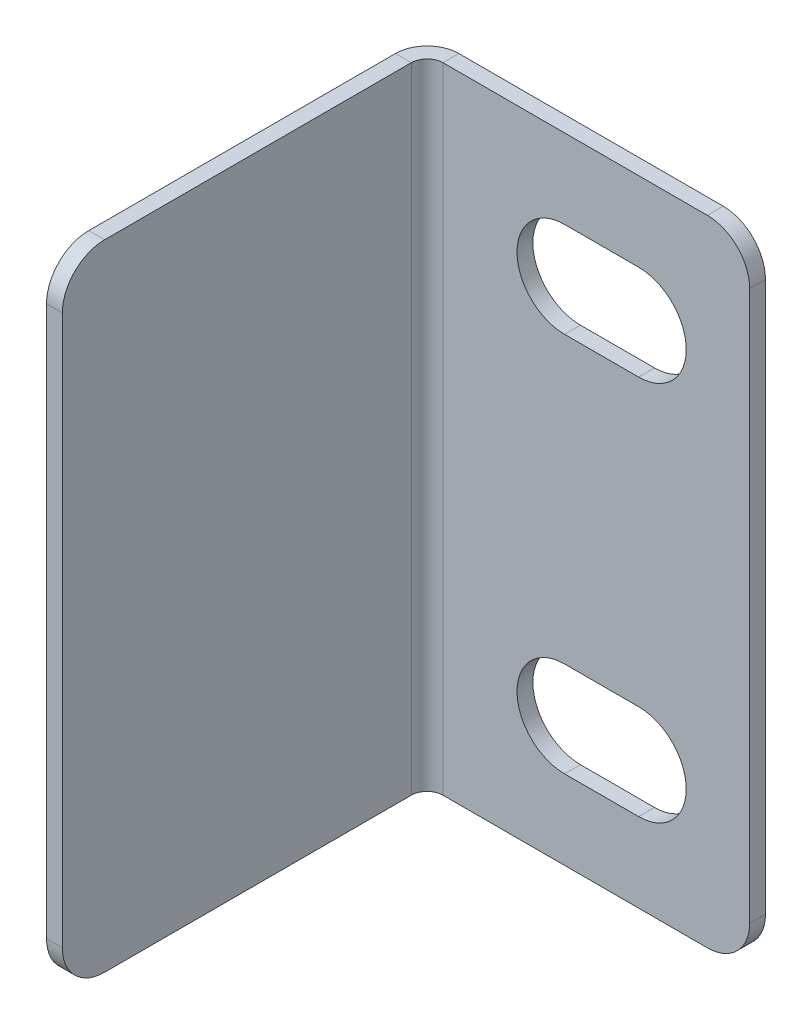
ISO-10303-21;
HEADER;
FILE_DESCRIPTION(('STEP AP214'),'2;1');
FILE_NAME('part.step','',(''),(''),'','','');
FILE_SCHEMA(('AUTOMOTIVE_DESIGN { 1 0 10303 214 1 1 1 1 }'));
ENDSEC;
DATA;
#1=APPLICATION_CONTEXT('core data for automotive mechanical design processes');
#2=APPLICATION_PROTOCOL_DEFINITION('international standard','automotive_design',2000,#1);
#3=PRODUCT_CONTEXT('',#1,'mechanical');
#4=PRODUCT('Part','Part','',(#3));
#5=PRODUCT_RELATED_PRODUCT_CATEGORY('part','',(#4));
#6=PRODUCT_DEFINITION_FORMATION('','',#4);
#7=PRODUCT_DEFINITION_CONTEXT('part definition',#1,'design');
#8=PRODUCT_DEFINITION('design','',#6,#7);
#9=PRODUCT_DEFINITION_SHAPE('','',#8);
#10=(LENGTH_UNIT() NAMED_UNIT(*) SI_UNIT(.MILLI.,.METRE.));
#11=(NAMED_UNIT(*) PLANE_ANGLE_UNIT() SI_UNIT($,.RADIAN.));
#12=(NAMED_UNIT(*) SI_UNIT($,.STERADIAN.) SOLID_ANGLE_UNIT());
#13=UNCERTAINTY_MEASURE_WITH_UNIT(LENGTH_MEASURE(1.E-05),#10,'distance_accuracy_value','');
#14=(GEOMETRIC_REPRESENTATION_CONTEXT(3) GLOBAL_UNCERTAINTY_ASSIGNED_CONTEXT((#13)) GLOBAL_UNIT_ASSIGNED_CONTEXT((#10,
#11,#12)) REPRESENTATION_CONTEXT('',''));
#15=CARTESIAN_POINT('',(0.,0.,0.));
#16=DIRECTION('',(0.,0.,1.));
#17=DIRECTION('',(1.,0.,0.));
#18=AXIS2_PLACEMENT_3D('',#15,#16,#17);
#19=CARTESIAN_POINT('',(3.00000000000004,30.,0.));
#20=DIRECTION('',(0.,1.,0.));
#21=DIRECTION('',(0.,0.,1.));
#22=AXIS2_PLACEMENT_3D('',#19,#20,#21);
#23=PLANE('',#22);
#24=DIRECTION('',(0.,0.,1.));
#25=VECTOR('',#24,1.);
#26=CARTESIAN_POINT('',(3.00000000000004,30.,0.));
#27=LINE('',#26,#25);
#28=CARTESIAN_POINT('',(3.00000000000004,30.,0.));
#29=VERTEX_POINT('',#28);
#30=CARTESIAN_POINT('',(3.00000000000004,30.,1.50000000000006));
#31=VERTEX_POINT('',#30);
#32=EDGE_CURVE('E355',#29,#31,#27,.T.);
#33=ORIENTED_EDGE('',*,*,#32,.F.);
#34=CARTESIAN_POINT('',(3.00000000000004,30.,2.99999999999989));
#35=DIRECTION('',(0.,-1.,0.));
#36=DIRECTION('',(0.,0.,-1.));
#37=AXIS2_PLACEMENT_3D('',#34,#35,#36);
#38=CIRCLE('',#37,3.);
#39=CARTESIAN_POINT('',(0.,30.,2.99999999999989));
#40=VERTEX_POINT('',#39);
#41=EDGE_CURVE('E289',#29,#40,#38,.F.);
#42=ORIENTED_EDGE('',*,*,#41,.T.);
#43=DIRECTION('',(-1.00000000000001,0.,0.));
#44=VECTOR('',#43,1.);
#45=CARTESIAN_POINT('',(1.5,30.,2.99999999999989));
#46=LINE('',#45,#44);
#47=CARTESIAN_POINT('',(1.5,30.,2.99999999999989));
#48=VERTEX_POINT('',#47);
#49=EDGE_CURVE('E352',#48,#40,#46,.T.);
#50=ORIENTED_EDGE('',*,*,#49,.F.);
#51=CARTESIAN_POINT('',(3.00000000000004,30.,2.99999999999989));
#52=DIRECTION('',(0.,1.,0.));
#53=DIRECTION('',(1.00000000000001,0.,0.));
#54=AXIS2_PLACEMENT_3D('',#51,#52,#53);
#55=CIRCLE('',#54,1.5);
#56=EDGE_CURVE('E279',#31,#48,#55,.T.);
#57=ORIENTED_EDGE('',*,*,#56,.F.);
#58=EDGE_LOOP('',(#33,#42,#50,#57));
#59=FACE_BOUND('',#58,.T.);
#60=ADVANCED_FACE('F40',(#59),#23,.T.);
#61=CARTESIAN_POINT('',(1.5,30.,2.99999999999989));
#62=DIRECTION('',(0.,1.,0.));
#63=DIRECTION('',(0.,0.,1.));
#64=AXIS2_PLACEMENT_3D('',#61,#62,#63);
#65=PLANE('',#64);
#66=DIRECTION('',(1.00000000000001,0.,0.));
#67=VECTOR('',#66,1.);
#68=CARTESIAN_POINT('',(0.,30.,1.50000000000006));
#69=LINE('',#68,#67);
#70=CARTESIAN_POINT('',(28.0000000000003,30.,1.50000000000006));
#71=VERTEX_POINT('',#70);
#72=EDGE_CURVE('E283',#71,#31,#69,.F.);
#73=ORIENTED_EDGE('',*,*,#72,.F.);
#74=DIRECTION('',(0.,0.,1.));
#75=VECTOR('',#74,1.);
#76=CARTESIAN_POINT('',(28.0000000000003,30.,2.99999999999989));
#77=LINE('',#76,#75);
#78=CARTESIAN_POINT('',(28.0000000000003,30.,0.));
#79=VERTEX_POINT('',#78);
#80=EDGE_CURVE('E11',#71,#79,#77,.F.);
#81=ORIENTED_EDGE('',*,*,#80,.T.);
#82=DIRECTION('',(-1.00000000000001,0.,0.));
#83=VECTOR('',#82,1.);
#84=CARTESIAN_POINT('',(0.,30.,0.));
#85=LINE('',#84,#83);
#86=EDGE_CURVE('E286',#79,#29,#85,.T.);
#87=ORIENTED_EDGE('',*,*,#86,.T.);
#88=ORIENTED_EDGE('',*,*,#32,.T.);
#89=EDGE_LOOP('',(#73,#81,#87,#88));
#90=FACE_BOUND('',#89,.T.);
#91=ADVANCED_FACE('F430',(#90),#65,.T.);
#92=CARTESIAN_POINT('',(0.,-30.,2.99999999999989));
#93=DIRECTION('',(0.,-1.,0.));
#94=DIRECTION('',(0.,0.,-1.));
#95=AXIS2_PLACEMENT_3D('',#92,#93,#94);
#96=PLANE('',#95);
#97=DIRECTION('',(1.00000000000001,0.,0.));
#98=VECTOR('',#97,1.);
#99=CARTESIAN_POINT('',(0.,-30.,2.99999999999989));
#100=LINE('',#99,#98);
#101=CARTESIAN_POINT('',(0.,-30.,2.99999999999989));
#102=VERTEX_POINT('',#101);
#103=CARTESIAN_POINT('',(1.5,-30.,2.99999999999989));
#104=VERTEX_POINT('',#103);
#105=EDGE_CURVE('E349',#102,#104,#100,.T.);
#106=ORIENTED_EDGE('',*,*,#105,.F.);
#107=CARTESIAN_POINT('',(3.00000000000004,-30.,2.99999999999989));
#108=DIRECTION('',(0.,-1.,0.));
#109=DIRECTION('',(0.,0.,-1.));
#110=AXIS2_PLACEMENT_3D('',#107,#108,#109);
#111=CIRCLE('',#110,3.);
#112=CARTESIAN_POINT('',(3.00000000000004,-30.,0.));
#113=VERTEX_POINT('',#112);
#114=EDGE_CURVE('E275',#113,#102,#111,.F.);
#115=ORIENTED_EDGE('',*,*,#114,.F.);
#116=DIRECTION('',(0.,0.,-1.));
#117=VECTOR('',#116,1.);
#118=CARTESIAN_POINT('',(3.00000000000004,-30.,1.50000000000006));
#119=LINE('',#118,#117);
#120=CARTESIAN_POINT('',(3.00000000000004,-30.,1.50000000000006));
#121=VERTEX_POINT('',#120);
#122=EDGE_CURVE('E345',#121,#113,#119,.T.);
#123=ORIENTED_EDGE('',*,*,#122,.F.);
#124=CARTESIAN_POINT('',(3.00000000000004,-30.,2.99999999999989));
#125=DIRECTION('',(0.,1.,0.));
#126=DIRECTION('',(1.00000000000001,0.,0.));
#127=AXIS2_PLACEMENT_3D('',#124,#125,#126);
#128=CIRCLE('',#127,1.5);
#129=EDGE_CURVE('E301',#121,#104,#128,.T.);
#130=ORIENTED_EDGE('',*,*,#129,.T.);
#131=EDGE_LOOP('',(#106,#115,#123,#130));
#132=FACE_BOUND('',#131,.T.);
#133=ADVANCED_FACE('F468',(#132),#96,.T.);
#134=CARTESIAN_POINT('',(3.00000000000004,-30.,1.50000000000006));
#135=DIRECTION('',(0.,-1.,0.));
#136=DIRECTION('',(0.,0.,-1.));
#137=AXIS2_PLACEMENT_3D('',#134,#135,#136);
#138=PLANE('',#137);
#139=DIRECTION('',(0.,0.,-1.));
#140=VECTOR('',#139,1.);
#141=CARTESIAN_POINT('',(1.5,-30.,0.));
#142=LINE('',#141,#140);
#143=CARTESIAN_POINT('',(1.50000000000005,-30.0000000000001,32.));
#144=VERTEX_POINT('',#143);
#145=EDGE_CURVE('E297',#104,#144,#142,.F.);
#146=ORIENTED_EDGE('',*,*,#145,.T.);
#147=DIRECTION('',(-1.00000000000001,0.,0.));
#148=VECTOR('',#147,1.);
#149=CARTESIAN_POINT('',(3.00000000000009,-30.0000000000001,32.));
#150=LINE('',#149,#148);
#151=CARTESIAN_POINT('',(0.,-30.0000000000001,32.));
#152=VERTEX_POINT('',#151);
#153=EDGE_CURVE('E381',#144,#152,#150,.T.);
#154=ORIENTED_EDGE('',*,*,#153,.T.);
#155=DIRECTION('',(0.,0.,1.));
#156=VECTOR('',#155,1.);
#157=CARTESIAN_POINT('',(0.,-30.,0.));
#158=LINE('',#157,#156);
#159=EDGE_CURVE('E195',#102,#152,#158,.T.);
#160=ORIENTED_EDGE('',*,*,#159,.F.);
#161=ORIENTED_EDGE('',*,*,#105,.T.);
#162=EDGE_LOOP('',(#146,#154,#160,#161));
#163=FACE_BOUND('',#162,.T.);
#164=ADVANCED_FACE('F464',(#163),#138,.T.);
#165=CARTESIAN_POINT('',(0.,30.,0.));
#166=DIRECTION('',(1.00000000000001,0.,0.));
#167=DIRECTION('',(0.,0.,-1.));
#168=AXIS2_PLACEMENT_3D('',#165,#166,#167);
#169=PLANE('',#168);
#170=DIRECTION('',(0.,-1.,0.));
#171=VECTOR('',#170,1.);
#172=CARTESIAN_POINT('',(0.,30.,36.));
#173=LINE('',#172,#171);
#174=CARTESIAN_POINT('',(0.,26.,36.));
#175=VERTEX_POINT('',#174);
#176=CARTESIAN_POINT('',(0.,-26.,36.));
#177=VERTEX_POINT('',#176);
#178=EDGE_CURVE('E341',#175,#177,#173,.T.);
#179=ORIENTED_EDGE('',*,*,#178,.F.);
#180=CARTESIAN_POINT('',(0.,26.,32.));
#181=DIRECTION('',(1.00000000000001,0.,0.));
#182=DIRECTION('',(0.,0.,-1.));
#183=AXIS2_PLACEMENT_3D('',#180,#181,#182);
#184=CIRCLE('',#183,4.);
#185=CARTESIAN_POINT('',(0.,30.,32.));
#186=VERTEX_POINT('',#185);
#187=EDGE_CURVE('E369',#175,#186,#184,.F.);
#188=ORIENTED_EDGE('',*,*,#187,.T.);
#189=DIRECTION('',(0.,0.,1.));
#190=VECTOR('',#189,1.);
#191=CARTESIAN_POINT('',(0.,30.,0.));
#192=LINE('',#191,#190);
#193=EDGE_CURVE('E270',#40,#186,#192,.T.);
#194=ORIENTED_EDGE('',*,*,#193,.F.);
#195=DIRECTION('',(0.,-1.,0.));
#196=VECTOR('',#195,1.);
#197=CARTESIAN_POINT('',(0.,30.,2.99999999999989));
#198=LINE('',#197,#196);
#199=EDGE_CURVE('E293',#40,#102,#198,.T.);
#200=ORIENTED_EDGE('',*,*,#199,.T.);
#201=ORIENTED_EDGE('',*,*,#159,.T.);
#202=CARTESIAN_POINT('',(0.,-26.,32.));
#203=DIRECTION('',(1.00000000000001,0.,0.));
#204=DIRECTION('',(0.,0.,-1.));
#205=AXIS2_PLACEMENT_3D('',#202,#203,#204);
#206=CIRCLE('',#205,4.);
#207=EDGE_CURVE('E366',#152,#177,#206,.F.);
#208=ORIENTED_EDGE('',*,*,#207,.T.);
#209=EDGE_LOOP('',(#179,#188,#194,#200,#201,#208));
#210=FACE_BOUND('',#209,.T.);
#211=ADVANCED_FACE('F472',(#210),#169,.F.);
#212=CARTESIAN_POINT('',(1.50000000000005,30.,36.));
#213=DIRECTION('',(0.,0.,1.));
#214=DIRECTION('',(1.00000000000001,0.,0.));
#215=AXIS2_PLACEMENT_3D('',#212,#213,#214);
#216=PLANE('',#215);
#217=DIRECTION('',(0.,-1.,0.));
#218=VECTOR('',#217,1.);
#219=CARTESIAN_POINT('',(1.50000000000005,30.,36.));
#220=LINE('',#219,#218);
#221=CARTESIAN_POINT('',(1.50000000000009,26.,36.));
#222=VERTEX_POINT('',#221);
#223=CARTESIAN_POINT('',(1.50000000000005,-26.,36.));
#224=VERTEX_POINT('',#223);
#225=EDGE_CURVE('E337',#222,#224,#220,.T.);
#226=ORIENTED_EDGE('',*,*,#225,.F.);
#227=DIRECTION('',(-1.00000000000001,0.,0.));
#228=VECTOR('',#227,1.);
#229=CARTESIAN_POINT('',(1.50000000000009,26.,36.));
#230=LINE('',#229,#228);
#231=EDGE_CURVE('E362',#222,#175,#230,.T.);
#232=ORIENTED_EDGE('',*,*,#231,.T.);
#233=ORIENTED_EDGE('',*,*,#178,.T.);
#234=DIRECTION('',(-1.00000000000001,0.,0.));
#235=VECTOR('',#234,1.);
#236=CARTESIAN_POINT('',(1.50000000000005,-26.,36.));
#237=LINE('',#236,#235);
#238=EDGE_CURVE('E359',#177,#224,#237,.F.);
#239=ORIENTED_EDGE('',*,*,#238,.T.);
#240=EDGE_LOOP('',(#226,#232,#233,#239));
#241=FACE_BOUND('',#240,.T.);
#242=ADVANCED_FACE('F457',(#241),#216,.T.);
#243=CARTESIAN_POINT('',(1.5,30.,0.));
#244=DIRECTION('',(1.00000000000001,0.,0.));
#245=DIRECTION('',(0.,0.,-1.));
#246=AXIS2_PLACEMENT_3D('',#243,#244,#245);
#247=PLANE('',#246);
#248=DIRECTION('',(0.,0.,-1.));
#249=VECTOR('',#248,1.);
#250=CARTESIAN_POINT('',(1.5,30.,0.));
#251=LINE('',#250,#249);
#252=CARTESIAN_POINT('',(1.50000000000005,30.,32.));
#253=VERTEX_POINT('',#252);
#254=EDGE_CURVE('E274',#48,#253,#251,.F.);
#255=ORIENTED_EDGE('',*,*,#254,.T.);
#256=CARTESIAN_POINT('',(1.50000000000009,26.,32.));
#257=DIRECTION('',(1.00000000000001,0.,0.));
#258=DIRECTION('',(0.,0.,-1.));
#259=AXIS2_PLACEMENT_3D('',#256,#257,#258);
#260=CIRCLE('',#259,4.);
#261=EDGE_CURVE('E378',#253,#222,#260,.T.);
#262=ORIENTED_EDGE('',*,*,#261,.T.);
#263=ORIENTED_EDGE('',*,*,#225,.T.);
#264=CARTESIAN_POINT('',(1.50000000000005,-26.,32.));
#265=DIRECTION('',(1.00000000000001,0.,0.));
#266=DIRECTION('',(0.,0.,-1.));
#267=AXIS2_PLACEMENT_3D('',#264,#265,#266);
#268=CIRCLE('',#267,4.);
#269=EDGE_CURVE('E375',#224,#144,#268,.T.);
#270=ORIENTED_EDGE('',*,*,#269,.T.);
#271=ORIENTED_EDGE('',*,*,#145,.F.);
#272=DIRECTION('',(0.,-1.,0.));
#273=VECTOR('',#272,1.);
#274=CARTESIAN_POINT('',(1.5,30.,2.99999999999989));
#275=LINE('',#274,#273);
#276=EDGE_CURVE('E333',#48,#104,#275,.T.);
#277=ORIENTED_EDGE('',*,*,#276,.F.);
#278=EDGE_LOOP('',(#255,#262,#263,#270,#271,#277));
#279=FACE_BOUND('',#278,.T.);
#280=ADVANCED_FACE('F446',(#279),#247,.T.);
#281=CARTESIAN_POINT('',(3.00000000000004,30.,2.99999999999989));
#282=DIRECTION('',(0.,-1.,0.));
#283=DIRECTION('',(0.,0.,-1.));
#284=AXIS2_PLACEMENT_3D('',#281,#282,#283);
#285=CYLINDRICAL_SURFACE('',#284,1.5);
#286=ORIENTED_EDGE('',*,*,#129,.F.);
#287=DIRECTION('',(0.,-1.,0.));
#288=VECTOR('',#287,1.);
#289=CARTESIAN_POINT('',(3.00000000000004,30.,1.50000000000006));
#290=LINE('',#289,#288);
#291=EDGE_CURVE('E329',#31,#121,#290,.T.);
#292=ORIENTED_EDGE('',*,*,#291,.F.);
#293=ORIENTED_EDGE('',*,*,#56,.T.);
#294=ORIENTED_EDGE('',*,*,#276,.T.);
#295=EDGE_LOOP('',(#286,#292,#293,#294));
#296=FACE_BOUND('',#295,.T.);
#297=ADVANCED_FACE('F438',(#296),#285,.F.);
#298=CARTESIAN_POINT('',(0.,30.,1.50000000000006));
#299=DIRECTION('',(0.,0.,1.));
#300=DIRECTION('',(1.00000000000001,0.,0.));
#301=AXIS2_PLACEMENT_3D('',#298,#299,#300);
#302=PLANE('',#301);
#303=CARTESIAN_POINT('',(14.5000000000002,18.,1.50000000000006));
#304=DIRECTION('',(0.,0.,1.));
#305=DIRECTION('',(1.00000000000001,0.,0.));
#306=AXIS2_PLACEMENT_3D('',#303,#304,#305);
#307=CIRCLE('',#306,4.5);
#308=CARTESIAN_POINT('',(14.5000000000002,22.5,1.50000000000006));
#309=VERTEX_POINT('',#308);
#310=CARTESIAN_POINT('',(14.5000000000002,13.5,1.50000000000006));
#311=VERTEX_POINT('',#310);
#312=EDGE_CURVE('E56',#309,#311,#307,.T.);
#313=ORIENTED_EDGE('',*,*,#312,.F.);
#314=DIRECTION('',(-1.00000000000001,0.,0.));
#315=VECTOR('',#314,1.);
#316=CARTESIAN_POINT('',(14.5000000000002,22.5,1.50000000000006));
#317=LINE('',#316,#315);
#318=CARTESIAN_POINT('',(21.5000000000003,22.5,1.50000000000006));
#319=VERTEX_POINT('',#318);
#320=EDGE_CURVE('E186',#319,#309,#317,.T.);
#321=ORIENTED_EDGE('',*,*,#320,.F.);
#322=CARTESIAN_POINT('',(21.5000000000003,18.,1.50000000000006));
#323=DIRECTION('',(0.,0.,1.));
#324=DIRECTION('',(1.00000000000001,0.,0.));
#325=AXIS2_PLACEMENT_3D('',#322,#323,#324);
#326=CIRCLE('',#325,4.5);
#327=CARTESIAN_POINT('',(21.5000000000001,13.5,1.50000000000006));
#328=VERTEX_POINT('',#327);
#329=EDGE_CURVE('E215',#328,#319,#326,.T.);
#330=ORIENTED_EDGE('',*,*,#329,.F.);
#331=DIRECTION('',(1.00000000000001,0.,0.));
#332=VECTOR('',#331,1.);
#333=CARTESIAN_POINT('',(14.5000000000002,13.5,1.50000000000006));
#334=LINE('',#333,#332);
#335=EDGE_CURVE('E207',#311,#328,#334,.T.);
#336=ORIENTED_EDGE('',*,*,#335,.F.);
#337=EDGE_LOOP('',(#313,#321,#330,#336));
#338=FACE_BOUND('',#337,.T.);
#339=CARTESIAN_POINT('',(14.5000000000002,-18.,1.50000000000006));
#340=DIRECTION('',(0.,0.,1.));
#341=DIRECTION('',(-1.00000000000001,0.,0.));
#342=AXIS2_PLACEMENT_3D('',#339,#340,#341);
#343=CIRCLE('',#342,4.5);
#344=CARTESIAN_POINT('',(14.5000000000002,-13.5,1.50000000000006));
#345=VERTEX_POINT('',#344);
#346=CARTESIAN_POINT('',(14.5000000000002,-22.5,1.50000000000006));
#347=VERTEX_POINT('',#346);
#348=EDGE_CURVE('E64',#345,#347,#343,.T.);
#349=ORIENTED_EDGE('',*,*,#348,.F.);
#350=DIRECTION('',(-1.00000000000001,0.,0.));
#351=VECTOR('',#350,1.);
#352=CARTESIAN_POINT('',(14.5000000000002,-13.5,1.50000000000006));
#353=LINE('',#352,#351);
#354=CARTESIAN_POINT('',(21.5000000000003,-13.5,1.50000000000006));
#355=VERTEX_POINT('',#354);
#356=EDGE_CURVE('E250',#355,#345,#353,.T.);
#357=ORIENTED_EDGE('',*,*,#356,.F.);
#358=CARTESIAN_POINT('',(21.5000000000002,-18.,1.50000000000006));
#359=DIRECTION('',(0.,0.,1.));
#360=DIRECTION('',(-1.00000000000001,0.,0.));
#361=AXIS2_PLACEMENT_3D('',#358,#359,#360);
#362=CIRCLE('',#361,4.5);
#363=CARTESIAN_POINT('',(21.5000000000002,-22.5,1.50000000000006));
#364=VERTEX_POINT('',#363);
#365=EDGE_CURVE('E246',#364,#355,#362,.T.);
#366=ORIENTED_EDGE('',*,*,#365,.F.);
#367=DIRECTION('',(1.00000000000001,0.,0.));
#368=VECTOR('',#367,1.);
#369=CARTESIAN_POINT('',(14.5000000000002,-22.5,1.50000000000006));
#370=LINE('',#369,#368);
#371=EDGE_CURVE('E242',#347,#364,#370,.T.);
#372=ORIENTED_EDGE('',*,*,#371,.F.);
#373=EDGE_LOOP('',(#349,#357,#366,#372));
#374=FACE_BOUND('',#373,.T.);
#375=DIRECTION('',(1.00000000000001,0.,0.));
#376=VECTOR('',#375,1.);
#377=CARTESIAN_POINT('',(0.,-30.,1.50000000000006));
#378=LINE('',#377,#376);
#379=CARTESIAN_POINT('',(28.0000000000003,-30.0000000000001,1.50000000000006));
#380=VERTEX_POINT('',#379);
#381=EDGE_CURVE('E305',#380,#121,#378,.F.);
#382=ORIENTED_EDGE('',*,*,#381,.F.);
#383=CARTESIAN_POINT('',(28.0000000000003,-26.,1.50000000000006));
#384=DIRECTION('',(0.,0.,1.));
#385=DIRECTION('',(1.00000000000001,0.,0.));
#386=AXIS2_PLACEMENT_3D('',#383,#384,#385);
#387=CIRCLE('',#386,4.);
#388=CARTESIAN_POINT('',(32.0000000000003,-26.,1.50000000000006));
#389=VERTEX_POINT('',#388);
#390=EDGE_CURVE('E392',#380,#389,#387,.T.);
#391=ORIENTED_EDGE('',*,*,#390,.T.);
#392=DIRECTION('',(0.,-1.,0.));
#393=VECTOR('',#392,1.);
#394=CARTESIAN_POINT('',(32.0000000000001,30.,1.50000000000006));
#395=LINE('',#394,#393);
#396=CARTESIAN_POINT('',(32.,26.,1.50000000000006));
#397=VERTEX_POINT('',#396);
#398=EDGE_CURVE('E325',#397,#389,#395,.T.);
#399=ORIENTED_EDGE('',*,*,#398,.F.);
#400=CARTESIAN_POINT('',(28.0000000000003,26.,1.50000000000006));
#401=DIRECTION('',(0.,0.,1.));
#402=DIRECTION('',(1.00000000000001,0.,0.));
#403=AXIS2_PLACEMENT_3D('',#400,#401,#402);
#404=CIRCLE('',#403,4.);
#405=EDGE_CURVE('E389',#397,#71,#404,.T.);
#406=ORIENTED_EDGE('',*,*,#405,.T.);
#407=ORIENTED_EDGE('',*,*,#72,.T.);
#408=ORIENTED_EDGE('',*,*,#291,.T.);
#409=EDGE_LOOP('',(#382,#391,#399,#406,#407,#408));
#410=FACE_BOUND('',#409,.T.);
#411=ADVANCED_FACE('F421',(#338,#374,#410),#302,.T.);
#412=CARTESIAN_POINT('',(32.0000000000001,30.,0.));
#413=DIRECTION('',(1.00000000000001,0.,0.));
#414=DIRECTION('',(0.,0.,-1.));
#415=AXIS2_PLACEMENT_3D('',#412,#413,#414);
#416=PLANE('',#415);
#417=ORIENTED_EDGE('',*,*,#398,.T.);
#418=DIRECTION('',(0.,0.,1.));
#419=VECTOR('',#418,1.);
#420=CARTESIAN_POINT('',(32.0000000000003,-26.,0.));
#421=LINE('',#420,#419);
#422=CARTESIAN_POINT('',(32.0000000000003,-26.,0.));
#423=VERTEX_POINT('',#422);
#424=EDGE_CURVE('E399',#389,#423,#421,.F.);
#425=ORIENTED_EDGE('',*,*,#424,.T.);
#426=DIRECTION('',(0.,-1.,0.));
#427=VECTOR('',#426,1.);
#428=CARTESIAN_POINT('',(32.0000000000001,30.,0.));
#429=LINE('',#428,#427);
#430=CARTESIAN_POINT('',(32.,26.,0.));
#431=VERTEX_POINT('',#430);
#432=EDGE_CURVE('E321',#431,#423,#429,.T.);
#433=ORIENTED_EDGE('',*,*,#432,.F.);
#434=DIRECTION('',(0.,0.,1.));
#435=VECTOR('',#434,1.);
#436=CARTESIAN_POINT('',(32.,26.,0.));
#437=LINE('',#436,#435);
#438=EDGE_CURVE('E395',#431,#397,#437,.T.);
#439=ORIENTED_EDGE('',*,*,#438,.T.);
#440=EDGE_LOOP('',(#417,#425,#433,#439));
#441=FACE_BOUND('',#440,.T.);
#442=ADVANCED_FACE('F423',(#441),#416,.T.);
#443=CARTESIAN_POINT('',(0.,30.,0.));
#444=DIRECTION('',(0.,0.,1.));
#445=DIRECTION('',(1.00000000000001,0.,0.));
#446=AXIS2_PLACEMENT_3D('',#443,#444,#445);
#447=PLANE('',#446);
#448=DIRECTION('',(1.00000000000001,0.,0.));
#449=VECTOR('',#448,1.);
#450=CARTESIAN_POINT('',(14.5000000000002,22.5,0.));
#451=LINE('',#450,#449);
#452=CARTESIAN_POINT('',(14.5000000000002,22.5,0.));
#453=VERTEX_POINT('',#452);
#454=CARTESIAN_POINT('',(21.5000000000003,22.5,0.));
#455=VERTEX_POINT('',#454);
#456=EDGE_CURVE('E201',#453,#455,#451,.T.);
#457=ORIENTED_EDGE('',*,*,#456,.F.);
#458=CARTESIAN_POINT('',(14.5000000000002,18.,0.));
#459=DIRECTION('',(0.,0.,1.));
#460=DIRECTION('',(1.00000000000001,0.,0.));
#461=AXIS2_PLACEMENT_3D('',#458,#459,#460);
#462=CIRCLE('',#461,4.5);
#463=CARTESIAN_POINT('',(14.5000000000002,13.5,0.));
#464=VERTEX_POINT('',#463);
#465=EDGE_CURVE('E179',#464,#453,#462,.F.);
#466=ORIENTED_EDGE('',*,*,#465,.F.);
#467=DIRECTION('',(-1.00000000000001,0.,0.));
#468=VECTOR('',#467,1.);
#469=CARTESIAN_POINT('',(14.5000000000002,13.5,0.));
#470=LINE('',#469,#468);
#471=CARTESIAN_POINT('',(21.5000000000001,13.5,0.));
#472=VERTEX_POINT('',#471);
#473=EDGE_CURVE('E190',#472,#464,#470,.T.);
#474=ORIENTED_EDGE('',*,*,#473,.F.);
#475=CARTESIAN_POINT('',(21.5000000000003,18.,0.));
#476=DIRECTION('',(0.,0.,1.));
#477=DIRECTION('',(1.00000000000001,0.,0.));
#478=AXIS2_PLACEMENT_3D('',#475,#476,#477);
#479=CIRCLE('',#478,4.5);
#480=EDGE_CURVE('E209',#455,#472,#479,.F.);
#481=ORIENTED_EDGE('',*,*,#480,.F.);
#482=EDGE_LOOP('',(#457,#466,#474,#481));
#483=FACE_BOUND('',#482,.T.);
#484=DIRECTION('',(1.00000000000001,0.,0.));
#485=VECTOR('',#484,1.);
#486=CARTESIAN_POINT('',(14.5000000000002,-13.5,0.));
#487=LINE('',#486,#485);
#488=CARTESIAN_POINT('',(14.5000000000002,-13.5,0.));
#489=VERTEX_POINT('',#488);
#490=CARTESIAN_POINT('',(21.5000000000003,-13.5,0.));
#491=VERTEX_POINT('',#490);
#492=EDGE_CURVE('E232',#489,#491,#487,.T.);
#493=ORIENTED_EDGE('',*,*,#492,.F.);
#494=CARTESIAN_POINT('',(14.5000000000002,-18.,0.));
#495=DIRECTION('',(0.,0.,1.));
#496=DIRECTION('',(1.00000000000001,0.,0.));
#497=AXIS2_PLACEMENT_3D('',#494,#495,#496);
#498=CIRCLE('',#497,4.5);
#499=CARTESIAN_POINT('',(14.5000000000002,-22.5,0.));
#500=VERTEX_POINT('',#499);
#501=EDGE_CURVE('E236',#500,#489,#498,.F.);
#502=ORIENTED_EDGE('',*,*,#501,.F.);
#503=DIRECTION('',(-1.00000000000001,0.,0.));
#504=VECTOR('',#503,1.);
#505=CARTESIAN_POINT('',(14.5000000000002,-22.5,0.));
#506=LINE('',#505,#504);
#507=CARTESIAN_POINT('',(21.5000000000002,-22.5,0.));
#508=VERTEX_POINT('',#507);
#509=EDGE_CURVE('E258',#508,#500,#506,.T.);
#510=ORIENTED_EDGE('',*,*,#509,.F.);
#511=CARTESIAN_POINT('',(21.5000000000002,-18.,0.));
#512=DIRECTION('',(0.,0.,1.));
#513=DIRECTION('',(1.00000000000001,0.,0.));
#514=AXIS2_PLACEMENT_3D('',#511,#512,#513);
#515=CIRCLE('',#514,4.5);
#516=EDGE_CURVE('E229',#491,#508,#515,.F.);
#517=ORIENTED_EDGE('',*,*,#516,.F.);
#518=EDGE_LOOP('',(#493,#502,#510,#517));
#519=FACE_BOUND('',#518,.T.);
#520=ORIENTED_EDGE('',*,*,#432,.T.);
#521=CARTESIAN_POINT('',(28.0000000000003,-26.,0.));
#522=DIRECTION('',(0.,0.,1.));
#523=DIRECTION('',(1.00000000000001,0.,0.));
#524=AXIS2_PLACEMENT_3D('',#521,#522,#523);
#525=CIRCLE('',#524,4.);
#526=CARTESIAN_POINT('',(28.0000000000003,-30.0000000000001,0.));
#527=VERTEX_POINT('',#526);
#528=EDGE_CURVE('E49',#423,#527,#525,.F.);
#529=ORIENTED_EDGE('',*,*,#528,.T.);
#530=DIRECTION('',(-1.00000000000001,0.,0.));
#531=VECTOR('',#530,1.);
#532=CARTESIAN_POINT('',(0.,-30.,0.));
#533=LINE('',#532,#531);
#534=EDGE_CURVE('E308',#527,#113,#533,.T.);
#535=ORIENTED_EDGE('',*,*,#534,.T.);
#536=DIRECTION('',(0.,-1.,0.));
#537=VECTOR('',#536,1.);
#538=CARTESIAN_POINT('',(3.00000000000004,30.,0.));
#539=LINE('',#538,#537);
#540=EDGE_CURVE('E317',#29,#113,#539,.T.);
#541=ORIENTED_EDGE('',*,*,#540,.F.);
#542=ORIENTED_EDGE('',*,*,#86,.F.);
#543=CARTESIAN_POINT('',(28.0000000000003,26.,0.));
#544=DIRECTION('',(0.,0.,1.));
#545=DIRECTION('',(1.00000000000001,0.,0.));
#546=AXIS2_PLACEMENT_3D('',#543,#544,#545);
#547=CIRCLE('',#546,4.);
#548=EDGE_CURVE('E402',#79,#431,#547,.F.);
#549=ORIENTED_EDGE('',*,*,#548,.T.);
#550=EDGE_LOOP('',(#520,#529,#535,#541,#542,#549));
#551=FACE_BOUND('',#550,.T.);
#552=ADVANCED_FACE('F198',(#483,#519,#551),#447,.F.);
#553=CARTESIAN_POINT('',(3.00000000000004,30.,2.99999999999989));
#554=DIRECTION('',(0.,-1.,0.));
#555=DIRECTION('',(0.,0.,-1.));
#556=AXIS2_PLACEMENT_3D('',#553,#554,#555);
#557=CYLINDRICAL_SURFACE('',#556,3.);
#558=ORIENTED_EDGE('',*,*,#114,.T.);
#559=ORIENTED_EDGE('',*,*,#199,.F.);
#560=ORIENTED_EDGE('',*,*,#41,.F.);
#561=ORIENTED_EDGE('',*,*,#540,.T.);
#562=EDGE_LOOP('',(#558,#559,#560,#561));
#563=FACE_BOUND('',#562,.T.);
#564=ADVANCED_FACE('F470',(#563),#557,.T.);
#565=CARTESIAN_POINT('',(3.00000000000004,30.,2.99999999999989));
#566=DIRECTION('',(0.,1.,0.));
#567=DIRECTION('',(1.00000000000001,0.,0.));
#568=AXIS2_PLACEMENT_3D('',#565,#566,#567);
#569=PLANE('',#568);
#570=ORIENTED_EDGE('',*,*,#193,.T.);
#571=DIRECTION('',(-1.00000000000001,0.,0.));
#572=VECTOR('',#571,1.);
#573=CARTESIAN_POINT('',(3.00000000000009,30.,32.));
#574=LINE('',#573,#572);
#575=EDGE_CURVE('E372',#186,#253,#574,.F.);
#576=ORIENTED_EDGE('',*,*,#575,.T.);
#577=ORIENTED_EDGE('',*,*,#254,.F.);
#578=ORIENTED_EDGE('',*,*,#49,.T.);
#579=EDGE_LOOP('',(#570,#576,#577,#578));
#580=FACE_BOUND('',#579,.T.);
#581=ADVANCED_FACE('F448',(#580),#569,.T.);
#582=CARTESIAN_POINT('',(3.00000000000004,-30.,2.99999999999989));
#583=DIRECTION('',(0.,1.,0.));
#584=DIRECTION('',(1.00000000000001,0.,0.));
#585=AXIS2_PLACEMENT_3D('',#582,#583,#584);
#586=PLANE('',#585);
#587=ORIENTED_EDGE('',*,*,#534,.F.);
#588=DIRECTION('',(0.,0.,1.));
#589=VECTOR('',#588,1.);
#590=CARTESIAN_POINT('',(28.0000000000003,-30.0000000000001,1.50000000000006));
#591=LINE('',#590,#589);
#592=EDGE_CURVE('E385',#527,#380,#591,.T.);
#593=ORIENTED_EDGE('',*,*,#592,.T.);
#594=ORIENTED_EDGE('',*,*,#381,.T.);
#595=ORIENTED_EDGE('',*,*,#122,.T.);
#596=EDGE_LOOP('',(#587,#593,#594,#595));
#597=FACE_BOUND('',#596,.T.);
#598=ADVANCED_FACE('F415',(#597),#586,.F.);
#599=CARTESIAN_POINT('',(1.50000000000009,26.,32.));
#600=DIRECTION('',(-1.00000000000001,0.,0.));
#601=DIRECTION('',(0.,0.,1.));
#602=AXIS2_PLACEMENT_3D('',#599,#600,#601);
#603=CYLINDRICAL_SURFACE('',#602,4.);
#604=ORIENTED_EDGE('',*,*,#261,.F.);
#605=ORIENTED_EDGE('',*,*,#575,.F.);
#606=ORIENTED_EDGE('',*,*,#187,.F.);
#607=ORIENTED_EDGE('',*,*,#231,.F.);
#608=EDGE_LOOP('',(#604,#605,#606,#607));
#609=FACE_BOUND('',#608,.T.);
#610=ADVANCED_FACE('F452',(#609),#603,.T.);
#611=CARTESIAN_POINT('',(3.00000000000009,-26.,32.));
#612=DIRECTION('',(-1.00000000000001,0.,0.));
#613=DIRECTION('',(0.,0.,1.));
#614=AXIS2_PLACEMENT_3D('',#611,#612,#613);
#615=CYLINDRICAL_SURFACE('',#614,4.);
#616=ORIENTED_EDGE('',*,*,#269,.F.);
#617=ORIENTED_EDGE('',*,*,#238,.F.);
#618=ORIENTED_EDGE('',*,*,#207,.F.);
#619=ORIENTED_EDGE('',*,*,#153,.F.);
#620=EDGE_LOOP('',(#616,#617,#618,#619));
#621=FACE_BOUND('',#620,.T.);
#622=ADVANCED_FACE('F461',(#621),#615,.T.);
#623=CARTESIAN_POINT('',(28.0000000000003,-26.,2.99999999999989));
#624=DIRECTION('',(0.,0.,-1.));
#625=DIRECTION('',(-1.00000000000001,0.,0.));
#626=AXIS2_PLACEMENT_3D('',#623,#624,#625);
#627=CYLINDRICAL_SURFACE('',#626,4.);
#628=ORIENTED_EDGE('',*,*,#528,.F.);
#629=ORIENTED_EDGE('',*,*,#424,.F.);
#630=ORIENTED_EDGE('',*,*,#390,.F.);
#631=ORIENTED_EDGE('',*,*,#592,.F.);
#632=EDGE_LOOP('',(#628,#629,#630,#631));
#633=FACE_BOUND('',#632,.T.);
#634=ADVANCED_FACE('F418',(#633),#627,.T.);
#635=CARTESIAN_POINT('',(28.0000000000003,26.,0.));
#636=DIRECTION('',(0.,0.,1.));
#637=DIRECTION('',(1.00000000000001,0.,0.));
#638=AXIS2_PLACEMENT_3D('',#635,#636,#637);
#639=CYLINDRICAL_SURFACE('',#638,4.);
#640=ORIENTED_EDGE('',*,*,#548,.F.);
#641=ORIENTED_EDGE('',*,*,#80,.F.);
#642=ORIENTED_EDGE('',*,*,#405,.F.);
#643=ORIENTED_EDGE('',*,*,#438,.F.);
#644=EDGE_LOOP('',(#640,#641,#642,#643));
#645=FACE_BOUND('',#644,.T.);
#646=ADVANCED_FACE('F42',(#645),#639,.T.);
#647=CARTESIAN_POINT('',(14.5000000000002,-18.,-0.000999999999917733));
#648=DIRECTION('',(0.,0.,1.));
#649=DIRECTION('',(1.00000000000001,0.,0.));
#650=AXIS2_PLACEMENT_3D('',#647,#648,#649);
#651=CYLINDRICAL_SURFACE('',#650,4.5);
#652=ORIENTED_EDGE('',*,*,#501,.T.);
#653=DIRECTION('',(0.,0.,1.));
#654=VECTOR('',#653,1.);
#655=CARTESIAN_POINT('',(14.5000000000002,-13.5,-0.000999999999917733));
#656=LINE('',#655,#654);
#657=EDGE_CURVE('E255',#489,#345,#656,.T.);
#658=ORIENTED_EDGE('',*,*,#657,.T.);
#659=ORIENTED_EDGE('',*,*,#348,.T.);
#660=DIRECTION('',(0.,0.,1.));
#661=VECTOR('',#660,1.);
#662=CARTESIAN_POINT('',(14.5000000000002,-22.5,-0.000999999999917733));
#663=LINE('',#662,#661);
#664=EDGE_CURVE('E254',#500,#347,#663,.T.);
#665=ORIENTED_EDGE('',*,*,#664,.F.);
#666=EDGE_LOOP('',(#652,#658,#659,#665));
#667=FACE_BOUND('',#666,.T.);
#668=ADVANCED_FACE('F496',(#667),#651,.F.);
#669=CARTESIAN_POINT('',(14.5000000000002,-13.5,-0.000999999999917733));
#670=DIRECTION('',(0.,1.,0.));
#671=DIRECTION('',(0.,0.,1.));
#672=AXIS2_PLACEMENT_3D('',#669,#670,#671);
#673=PLANE('',#672);
#674=ORIENTED_EDGE('',*,*,#492,.T.);
#675=DIRECTION('',(0.,0.,1.));
#676=VECTOR('',#675,1.);
#677=CARTESIAN_POINT('',(21.5000000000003,-13.5,-0.000999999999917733));
#678=LINE('',#677,#676);
#679=EDGE_CURVE('E259',#491,#355,#678,.T.);
#680=ORIENTED_EDGE('',*,*,#679,.T.);
#681=ORIENTED_EDGE('',*,*,#356,.T.);
#682=ORIENTED_EDGE('',*,*,#657,.F.);
#683=EDGE_LOOP('',(#674,#680,#681,#682));
#684=FACE_BOUND('',#683,.T.);
#685=ADVANCED_FACE('F500',(#684),#673,.F.);
#686=CARTESIAN_POINT('',(21.5000000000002,-18.,-0.000999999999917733));
#687=DIRECTION('',(0.,0.,1.));
#688=DIRECTION('',(1.00000000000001,0.,0.));
#689=AXIS2_PLACEMENT_3D('',#686,#687,#688);
#690=CYLINDRICAL_SURFACE('',#689,4.5);
#691=ORIENTED_EDGE('',*,*,#516,.T.);
#692=DIRECTION('',(0.,0.,1.));
#693=VECTOR('',#692,1.);
#694=CARTESIAN_POINT('',(21.5000000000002,-22.5,-0.000999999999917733));
#695=LINE('',#694,#693);
#696=EDGE_CURVE('E262',#508,#364,#695,.T.);
#697=ORIENTED_EDGE('',*,*,#696,.T.);
#698=ORIENTED_EDGE('',*,*,#365,.T.);
#699=ORIENTED_EDGE('',*,*,#679,.F.);
#700=EDGE_LOOP('',(#691,#697,#698,#699));
#701=FACE_BOUND('',#700,.T.);
#702=ADVANCED_FACE('F505',(#701),#690,.F.);
#703=CARTESIAN_POINT('',(14.5000000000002,-22.5,-0.000999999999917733));
#704=DIRECTION('',(0.,-1.,0.));
#705=DIRECTION('',(0.,0.,-1.));
#706=AXIS2_PLACEMENT_3D('',#703,#704,#705);
#707=PLANE('',#706);
#708=ORIENTED_EDGE('',*,*,#509,.T.);
#709=ORIENTED_EDGE('',*,*,#664,.T.);
#710=ORIENTED_EDGE('',*,*,#371,.T.);
#711=ORIENTED_EDGE('',*,*,#696,.F.);
#712=EDGE_LOOP('',(#708,#709,#710,#711));
#713=FACE_BOUND('',#712,.T.);
#714=ADVANCED_FACE('F510',(#713),#707,.F.);
#715=CARTESIAN_POINT('',(14.5000000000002,18.,-0.000999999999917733));
#716=DIRECTION('',(0.,0.,1.));
#717=DIRECTION('',(1.00000000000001,0.,0.));
#718=AXIS2_PLACEMENT_3D('',#715,#716,#717);
#719=CYLINDRICAL_SURFACE('',#718,4.5);
#720=ORIENTED_EDGE('',*,*,#465,.T.);
#721=DIRECTION('',(0.,0.,1.));
#722=VECTOR('',#721,1.);
#723=CARTESIAN_POINT('',(14.5000000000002,22.5,-0.000999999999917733));
#724=LINE('',#723,#722);
#725=EDGE_CURVE('E196',#453,#309,#724,.T.);
#726=ORIENTED_EDGE('',*,*,#725,.T.);
#727=ORIENTED_EDGE('',*,*,#312,.T.);
#728=DIRECTION('',(0.,0.,1.));
#729=VECTOR('',#728,1.);
#730=CARTESIAN_POINT('',(14.5000000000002,13.5,-0.000999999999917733));
#731=LINE('',#730,#729);
#732=EDGE_CURVE('E175',#464,#311,#731,.T.);
#733=ORIENTED_EDGE('',*,*,#732,.F.);
#734=EDGE_LOOP('',(#720,#726,#727,#733));
#735=FACE_BOUND('',#734,.T.);
#736=ADVANCED_FACE('F177',(#735),#719,.F.);
#737=CARTESIAN_POINT('',(14.5000000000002,22.5,-0.000999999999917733));
#738=DIRECTION('',(0.,1.,0.));
#739=DIRECTION('',(0.,0.,1.));
#740=AXIS2_PLACEMENT_3D('',#737,#738,#739);
#741=PLANE('',#740);
#742=ORIENTED_EDGE('',*,*,#456,.T.);
#743=DIRECTION('',(0.,0.,1.));
#744=VECTOR('',#743,1.);
#745=CARTESIAN_POINT('',(21.5000000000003,22.5,-0.000999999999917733));
#746=LINE('',#745,#744);
#747=EDGE_CURVE('E224',#455,#319,#746,.T.);
#748=ORIENTED_EDGE('',*,*,#747,.T.);
#749=ORIENTED_EDGE('',*,*,#320,.T.);
#750=ORIENTED_EDGE('',*,*,#725,.F.);
#751=EDGE_LOOP('',(#742,#748,#749,#750));
#752=FACE_BOUND('',#751,.T.);
#753=ADVANCED_FACE('F611',(#752),#741,.F.);
#754=CARTESIAN_POINT('',(21.5000000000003,18.,-0.000999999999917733));
#755=DIRECTION('',(0.,0.,1.));
#756=DIRECTION('',(1.00000000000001,0.,0.));
#757=AXIS2_PLACEMENT_3D('',#754,#755,#756);
#758=CYLINDRICAL_SURFACE('',#757,4.5);
#759=ORIENTED_EDGE('',*,*,#480,.T.);
#760=DIRECTION('',(0.,0.,1.));
#761=VECTOR('',#760,1.);
#762=CARTESIAN_POINT('',(21.5000000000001,13.5,-0.000999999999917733));
#763=LINE('',#762,#761);
#764=EDGE_CURVE('E185',#472,#328,#763,.T.);
#765=ORIENTED_EDGE('',*,*,#764,.T.);
#766=ORIENTED_EDGE('',*,*,#329,.T.);
#767=ORIENTED_EDGE('',*,*,#747,.F.);
#768=EDGE_LOOP('',(#759,#765,#766,#767));
#769=FACE_BOUND('',#768,.T.);
#770=ADVANCED_FACE('F620',(#769),#758,.F.);
#771=CARTESIAN_POINT('',(14.5000000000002,13.5,-0.000999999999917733));
#772=DIRECTION('',(0.,-1.,0.));
#773=DIRECTION('',(0.,0.,-1.));
#774=AXIS2_PLACEMENT_3D('',#771,#772,#773);
#775=PLANE('',#774);
#776=ORIENTED_EDGE('',*,*,#473,.T.);
#777=ORIENTED_EDGE('',*,*,#732,.T.);
#778=ORIENTED_EDGE('',*,*,#335,.T.);
#779=ORIENTED_EDGE('',*,*,#764,.F.);
#780=EDGE_LOOP('',(#776,#777,#778,#779));
#781=FACE_BOUND('',#780,.T.);
#782=ADVANCED_FACE('F191',(#781),#775,.F.);
#783=CLOSED_SHELL('',(#60,#91,#133,#164,#211,#242,#280,#297,#411,#442,#552,#564,#581,#598,#610,
#622,#634,#646,#668,#685,#702,#714,#736,#753,#770,#782));
#784=MANIFOLD_SOLID_BREP('B2',#783);
#785=ADVANCED_BREP_SHAPE_REPRESENTATION('',(#18,#784),#14);
#786=SHAPE_DEFINITION_REPRESENTATION(#9,#785);
ENDSEC;
END-ISO-10303-21;
